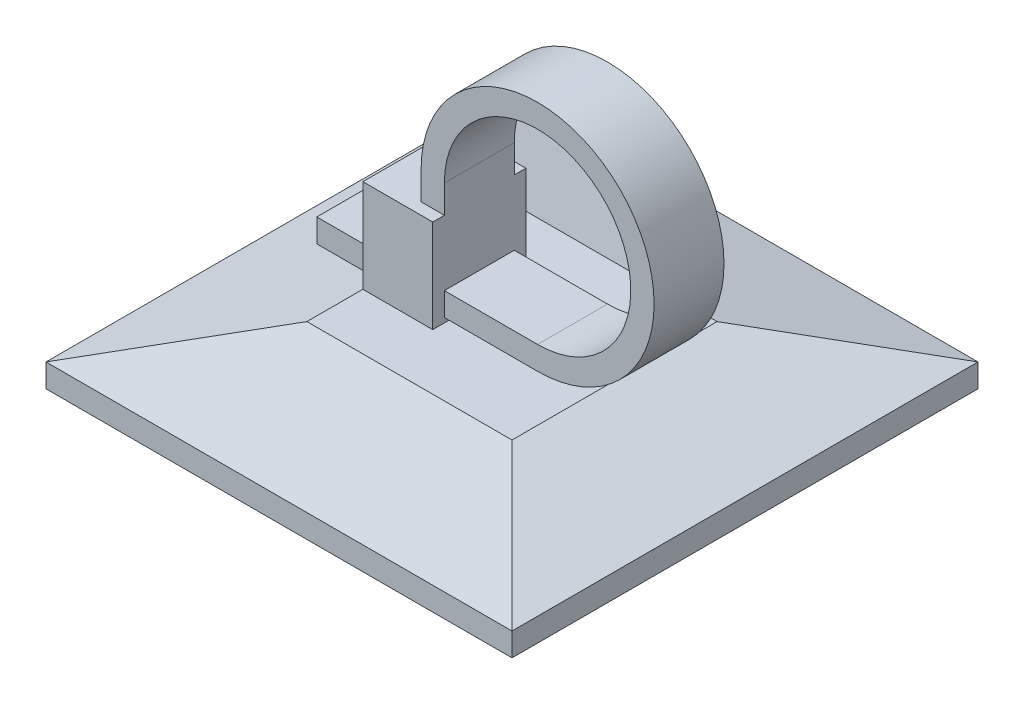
ISO-10303-21;
HEADER;
FILE_DESCRIPTION(('STEP AP214'),'2;1');
FILE_NAME('part.step','',(''),(''),'','','');
FILE_SCHEMA(('AUTOMOTIVE_DESIGN { 1 0 10303 214 1 1 1 1 }'));
ENDSEC;
DATA;
#1=APPLICATION_CONTEXT('core data for automotive mechanical design processes');
#2=APPLICATION_PROTOCOL_DEFINITION('international standard','automotive_design',2000,#1);
#3=PRODUCT_CONTEXT('',#1,'mechanical');
#4=PRODUCT('Part','Part','',(#3));
#5=PRODUCT_RELATED_PRODUCT_CATEGORY('part','',(#4));
#6=PRODUCT_DEFINITION_FORMATION('','',#4);
#7=PRODUCT_DEFINITION_CONTEXT('part definition',#1,'design');
#8=PRODUCT_DEFINITION('design','',#6,#7);
#9=PRODUCT_DEFINITION_SHAPE('','',#8);
#10=(LENGTH_UNIT() NAMED_UNIT(*) SI_UNIT(.MILLI.,.METRE.));
#11=(NAMED_UNIT(*) PLANE_ANGLE_UNIT() SI_UNIT($,.RADIAN.));
#12=(NAMED_UNIT(*) SI_UNIT($,.STERADIAN.) SOLID_ANGLE_UNIT());
#13=UNCERTAINTY_MEASURE_WITH_UNIT(LENGTH_MEASURE(1.E-05),#10,'distance_accuracy_value','');
#14=(GEOMETRIC_REPRESENTATION_CONTEXT(3) GLOBAL_UNCERTAINTY_ASSIGNED_CONTEXT((#13)) GLOBAL_UNIT_ASSIGNED_CONTEXT((#10,
#11,#12)) REPRESENTATION_CONTEXT('',''));
#15=CARTESIAN_POINT('',(0.,0.,0.));
#16=DIRECTION('',(0.,0.,1.));
#17=DIRECTION('',(1.,0.,0.));
#18=AXIS2_PLACEMENT_3D('',#15,#16,#17);
#19=CARTESIAN_POINT('',(-10.,2.5,-10.));
#20=DIRECTION('',(0.,1.,0.));
#21=DIRECTION('',(0.,0.,1.));
#22=AXIS2_PLACEMENT_3D('',#19,#20,#21);
#23=PLANE('',#22);
#24=DIRECTION('',(0.,0.,-1.));
#25=VECTOR('',#24,1.);
#26=CARTESIAN_POINT('',(-4.40192378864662,2.5,-10.));
#27=LINE('',#26,#25);
#28=CARTESIAN_POINT('',(-4.40192378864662,2.5,-4.40192378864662));
#29=VERTEX_POINT('',#28);
#30=CARTESIAN_POINT('',(-4.40192378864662,2.5,-2.));
#31=VERTEX_POINT('',#30);
#32=EDGE_CURVE('E300',#29,#31,#27,.F.);
#33=ORIENTED_EDGE('',*,*,#32,.T.);
#34=DIRECTION('',(1.,0.,0.));
#35=VECTOR('',#34,1.);
#36=CARTESIAN_POINT('',(-4.40192378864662,2.5,-2.));
#37=LINE('',#36,#35);
#38=CARTESIAN_POINT('',(-1.40192378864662,2.5,-2.));
#39=VERTEX_POINT('',#38);
#40=EDGE_CURVE('E277',#31,#39,#37,.T.);
#41=ORIENTED_EDGE('',*,*,#40,.T.);
#42=DIRECTION('',(0.,0.,-1.));
#43=VECTOR('',#42,1.);
#44=CARTESIAN_POINT('',(-1.40192378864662,2.5,2.));
#45=LINE('',#44,#43);
#46=CARTESIAN_POINT('',(-1.40192378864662,2.5,2.));
#47=VERTEX_POINT('',#46);
#48=EDGE_CURVE('E399',#47,#39,#45,.T.);
#49=ORIENTED_EDGE('',*,*,#48,.F.);
#50=DIRECTION('',(1.,0.,0.));
#51=VECTOR('',#50,1.);
#52=CARTESIAN_POINT('',(-4.40192378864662,2.5,2.));
#53=LINE('',#52,#51);
#54=CARTESIAN_POINT('',(-4.40192378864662,2.5,2.));
#55=VERTEX_POINT('',#54);
#56=EDGE_CURVE('E388',#55,#47,#53,.T.);
#57=ORIENTED_EDGE('',*,*,#56,.F.);
#58=CARTESIAN_POINT('',(-4.40192378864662,2.5,4.40192378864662));
#59=VERTEX_POINT('',#58);
#60=EDGE_CURVE('E305',#55,#59,#27,.F.);
#61=ORIENTED_EDGE('',*,*,#60,.T.);
#62=DIRECTION('',(-1.,0.,0.));
#63=VECTOR('',#62,1.);
#64=CARTESIAN_POINT('',(-10.,2.5,4.40192378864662));
#65=LINE('',#64,#63);
#66=CARTESIAN_POINT('',(4.40192378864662,2.5,4.40192378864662));
#67=VERTEX_POINT('',#66);
#68=EDGE_CURVE('E304',#59,#67,#65,.F.);
#69=ORIENTED_EDGE('',*,*,#68,.T.);
#70=DIRECTION('',(0.,0.,1.));
#71=VECTOR('',#70,1.);
#72=CARTESIAN_POINT('',(4.40192378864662,2.5,10.));
#73=LINE('',#72,#71);
#74=CARTESIAN_POINT('',(4.40192378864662,2.5,-4.40192378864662));
#75=VERTEX_POINT('',#74);
#76=EDGE_CURVE('E314',#67,#75,#73,.F.);
#77=ORIENTED_EDGE('',*,*,#76,.T.);
#78=DIRECTION('',(1.,0.,0.));
#79=VECTOR('',#78,1.);
#80=CARTESIAN_POINT('',(10.,2.5,-4.40192378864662));
#81=LINE('',#80,#79);
#82=EDGE_CURVE('E310',#75,#29,#81,.F.);
#83=ORIENTED_EDGE('',*,*,#82,.T.);
#84=EDGE_LOOP('',(#33,#41,#49,#57,#61,#69,#77,#83));
#85=FACE_BOUND('',#84,.T.);
#86=ADVANCED_FACE('F36',(#85),#23,.T.);
#87=CARTESIAN_POINT('',(-10.,1.,10.));
#88=DIRECTION('',(1.,0.,0.));
#89=DIRECTION('',(0.,0.,-1.));
#90=AXIS2_PLACEMENT_3D('',#87,#88,#89);
#91=PLANE('',#90);
#92=DIRECTION('',(0.,0.,1.));
#93=VECTOR('',#92,1.);
#94=CARTESIAN_POINT('',(-10.,0.,10.));
#95=LINE('',#94,#93);
#96=CARTESIAN_POINT('',(-10.,0.,-10.));
#97=VERTEX_POINT('',#96);
#98=CARTESIAN_POINT('',(-10.,0.,10.));
#99=VERTEX_POINT('',#98);
#100=EDGE_CURVE('E317',#97,#99,#95,.T.);
#101=ORIENTED_EDGE('',*,*,#100,.T.);
#102=DIRECTION('',(0.,-1.,0.));
#103=VECTOR('',#102,1.);
#104=CARTESIAN_POINT('',(-10.,1.,10.));
#105=LINE('',#104,#103);
#106=CARTESIAN_POINT('',(-10.,1.,10.));
#107=VERTEX_POINT('',#106);
#108=EDGE_CURVE('E285',#107,#99,#105,.T.);
#109=ORIENTED_EDGE('',*,*,#108,.F.);
#110=DIRECTION('',(0.,0.,1.));
#111=VECTOR('',#110,1.);
#112=CARTESIAN_POINT('',(-10.,1.,10.));
#113=LINE('',#112,#111);
#114=CARTESIAN_POINT('',(-10.,1.,-10.));
#115=VERTEX_POINT('',#114);
#116=EDGE_CURVE('E326',#115,#107,#113,.T.);
#117=ORIENTED_EDGE('',*,*,#116,.F.);
#118=DIRECTION('',(0.,-1.,0.));
#119=VECTOR('',#118,1.);
#120=CARTESIAN_POINT('',(-10.,1.,-10.));
#121=LINE('',#120,#119);
#122=EDGE_CURVE('E338',#115,#97,#121,.T.);
#123=ORIENTED_EDGE('',*,*,#122,.T.);
#124=EDGE_LOOP('',(#101,#109,#117,#123));
#125=FACE_BOUND('',#124,.T.);
#126=ADVANCED_FACE('F38',(#125),#91,.F.);
#127=CARTESIAN_POINT('',(-10.,1.,10.));
#128=DIRECTION('',(0.,0.,-1.));
#129=DIRECTION('',(-1.,0.,0.));
#130=AXIS2_PLACEMENT_3D('',#127,#128,#129);
#131=PLANE('',#130);
#132=DIRECTION('',(1.,0.,0.));
#133=VECTOR('',#132,1.);
#134=CARTESIAN_POINT('',(-10.,0.,10.));
#135=LINE('',#134,#133);
#136=CARTESIAN_POINT('',(10.,0.,10.));
#137=VERTEX_POINT('',#136);
#138=EDGE_CURVE('E319',#99,#137,#135,.T.);
#139=ORIENTED_EDGE('',*,*,#138,.T.);
#140=DIRECTION('',(0.,-1.,0.));
#141=VECTOR('',#140,1.);
#142=CARTESIAN_POINT('',(10.,1.,10.));
#143=LINE('',#142,#141);
#144=CARTESIAN_POINT('',(10.,1.,10.));
#145=VERTEX_POINT('',#144);
#146=EDGE_CURVE('E290',#145,#137,#143,.T.);
#147=ORIENTED_EDGE('',*,*,#146,.F.);
#148=DIRECTION('',(1.,0.,0.));
#149=VECTOR('',#148,1.);
#150=CARTESIAN_POINT('',(-10.,1.,10.));
#151=LINE('',#150,#149);
#152=EDGE_CURVE('E329',#107,#145,#151,.T.);
#153=ORIENTED_EDGE('',*,*,#152,.F.);
#154=ORIENTED_EDGE('',*,*,#108,.T.);
#155=EDGE_LOOP('',(#139,#147,#153,#154));
#156=FACE_BOUND('',#155,.T.);
#157=ADVANCED_FACE('F429',(#156),#131,.F.);
#158=CARTESIAN_POINT('',(10.,1.,10.));
#159=DIRECTION('',(-1.,0.,0.));
#160=DIRECTION('',(0.,0.,1.));
#161=AXIS2_PLACEMENT_3D('',#158,#159,#160);
#162=PLANE('',#161);
#163=DIRECTION('',(0.,0.,-1.));
#164=VECTOR('',#163,1.);
#165=CARTESIAN_POINT('',(10.,0.,10.));
#166=LINE('',#165,#164);
#167=CARTESIAN_POINT('',(10.,0.,-10.));
#168=VERTEX_POINT('',#167);
#169=EDGE_CURVE('E322',#137,#168,#166,.T.);
#170=ORIENTED_EDGE('',*,*,#169,.T.);
#171=DIRECTION('',(0.,-1.,0.));
#172=VECTOR('',#171,1.);
#173=CARTESIAN_POINT('',(10.,1.,-10.));
#174=LINE('',#173,#172);
#175=CARTESIAN_POINT('',(10.,1.,-10.));
#176=VERTEX_POINT('',#175);
#177=EDGE_CURVE('E296',#176,#168,#174,.T.);
#178=ORIENTED_EDGE('',*,*,#177,.F.);
#179=DIRECTION('',(0.,0.,-1.));
#180=VECTOR('',#179,1.);
#181=CARTESIAN_POINT('',(10.,1.,10.));
#182=LINE('',#181,#180);
#183=EDGE_CURVE('E332',#145,#176,#182,.T.);
#184=ORIENTED_EDGE('',*,*,#183,.F.);
#185=ORIENTED_EDGE('',*,*,#146,.T.);
#186=EDGE_LOOP('',(#170,#178,#184,#185));
#187=FACE_BOUND('',#186,.T.);
#188=ADVANCED_FACE('F428',(#187),#162,.F.);
#189=CARTESIAN_POINT('',(-10.,1.,-10.));
#190=DIRECTION('',(0.,0.,1.));
#191=DIRECTION('',(1.,0.,0.));
#192=AXIS2_PLACEMENT_3D('',#189,#190,#191);
#193=PLANE('',#192);
#194=DIRECTION('',(-1.,0.,0.));
#195=VECTOR('',#194,1.);
#196=CARTESIAN_POINT('',(-10.,0.,-10.));
#197=LINE('',#196,#195);
#198=EDGE_CURVE('E324',#168,#97,#197,.T.);
#199=ORIENTED_EDGE('',*,*,#198,.T.);
#200=ORIENTED_EDGE('',*,*,#122,.F.);
#201=DIRECTION('',(-1.,0.,0.));
#202=VECTOR('',#201,1.);
#203=CARTESIAN_POINT('',(-10.,1.,-10.));
#204=LINE('',#203,#202);
#205=EDGE_CURVE('E335',#176,#115,#204,.T.);
#206=ORIENTED_EDGE('',*,*,#205,.F.);
#207=ORIENTED_EDGE('',*,*,#177,.T.);
#208=EDGE_LOOP('',(#199,#200,#206,#207));
#209=FACE_BOUND('',#208,.T.);
#210=ADVANCED_FACE('F344',(#209),#193,.F.);
#211=CARTESIAN_POINT('',(-10.,0.,-10.));
#212=DIRECTION('',(0.,-1.,0.));
#213=DIRECTION('',(0.,0.,-1.));
#214=AXIS2_PLACEMENT_3D('',#211,#212,#213);
#215=PLANE('',#214);
#216=ORIENTED_EDGE('',*,*,#100,.F.);
#217=ORIENTED_EDGE('',*,*,#198,.F.);
#218=ORIENTED_EDGE('',*,*,#169,.F.);
#219=ORIENTED_EDGE('',*,*,#138,.F.);
#220=EDGE_LOOP('',(#216,#217,#218,#219));
#221=FACE_BOUND('',#220,.T.);
#222=ADVANCED_FACE('F351',(#221),#215,.T.);
#223=CARTESIAN_POINT('',(10.,1.,-10.));
#224=DIRECTION('',(0.,0.965925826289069,-0.258819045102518));
#225=DIRECTION('',(0.,0.258819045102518,0.965925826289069));
#226=AXIS2_PLACEMENT_3D('',#223,#224,#225);
#227=PLANE('',#226);
#228=ORIENTED_EDGE('',*,*,#205,.T.);
#229=DIRECTION('',(-0.694746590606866,-0.186156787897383,-0.694746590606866));
#230=VECTOR('',#229,1.);
#231=CARTESIAN_POINT('',(-10.,1.,-10.));
#232=LINE('',#231,#230);
#233=EDGE_CURVE('E320',#29,#115,#232,.T.);
#234=ORIENTED_EDGE('',*,*,#233,.F.);
#235=ORIENTED_EDGE('',*,*,#82,.F.);
#236=DIRECTION('',(0.694746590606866,-0.186156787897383,-0.694746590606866));
#237=VECTOR('',#236,1.);
#238=CARTESIAN_POINT('',(10.,1.,-10.));
#239=LINE('',#238,#237);
#240=EDGE_CURVE('E316',#75,#176,#239,.T.);
#241=ORIENTED_EDGE('',*,*,#240,.T.);
#242=EDGE_LOOP('',(#228,#234,#235,#241));
#243=FACE_BOUND('',#242,.T.);
#244=ADVANCED_FACE('F365',(#243),#227,.T.);
#245=CARTESIAN_POINT('',(-10.,1.,-10.));
#246=DIRECTION('',(-0.258819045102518,0.965925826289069,0.));
#247=DIRECTION('',(-0.965925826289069,-0.258819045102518,0.));
#248=AXIS2_PLACEMENT_3D('',#245,#246,#247);
#249=PLANE('',#248);
#250=ORIENTED_EDGE('',*,*,#116,.T.);
#251=DIRECTION('',(-0.694746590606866,-0.186156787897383,0.694746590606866));
#252=VECTOR('',#251,1.);
#253=CARTESIAN_POINT('',(-10.,1.,10.));
#254=LINE('',#253,#252);
#255=EDGE_CURVE('E362',#59,#107,#254,.T.);
#256=ORIENTED_EDGE('',*,*,#255,.F.);
#257=ORIENTED_EDGE('',*,*,#60,.F.);
#258=DIRECTION('',(0.,0.,-1.));
#259=VECTOR('',#258,1.);
#260=CARTESIAN_POINT('',(-4.40192378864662,2.5,2.));
#261=LINE('',#260,#259);
#262=EDGE_CURVE('E381',#55,#31,#261,.T.);
#263=ORIENTED_EDGE('',*,*,#262,.T.);
#264=ORIENTED_EDGE('',*,*,#32,.F.);
#265=ORIENTED_EDGE('',*,*,#233,.T.);
#266=EDGE_LOOP('',(#250,#256,#257,#263,#264,#265));
#267=FACE_BOUND('',#266,.T.);
#268=ADVANCED_FACE('F356',(#267),#249,.T.);
#269=CARTESIAN_POINT('',(-10.,1.,10.));
#270=DIRECTION('',(0.,0.965925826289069,0.258819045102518));
#271=DIRECTION('',(0.,-0.258819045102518,0.965925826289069));
#272=AXIS2_PLACEMENT_3D('',#269,#270,#271);
#273=PLANE('',#272);
#274=ORIENTED_EDGE('',*,*,#152,.T.);
#275=DIRECTION('',(0.694746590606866,-0.186156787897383,0.694746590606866));
#276=VECTOR('',#275,1.);
#277=CARTESIAN_POINT('',(10.,1.,10.));
#278=LINE('',#277,#276);
#279=EDGE_CURVE('E369',#67,#145,#278,.T.);
#280=ORIENTED_EDGE('',*,*,#279,.F.);
#281=ORIENTED_EDGE('',*,*,#68,.F.);
#282=ORIENTED_EDGE('',*,*,#255,.T.);
#283=EDGE_LOOP('',(#274,#280,#281,#282));
#284=FACE_BOUND('',#283,.T.);
#285=ADVANCED_FACE('F376',(#284),#273,.T.);
#286=CARTESIAN_POINT('',(10.,1.,10.));
#287=DIRECTION('',(0.258819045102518,0.965925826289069,0.));
#288=DIRECTION('',(-0.965925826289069,0.258819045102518,0.));
#289=AXIS2_PLACEMENT_3D('',#286,#287,#288);
#290=PLANE('',#289);
#291=ORIENTED_EDGE('',*,*,#183,.T.);
#292=ORIENTED_EDGE('',*,*,#240,.F.);
#293=ORIENTED_EDGE('',*,*,#76,.F.);
#294=ORIENTED_EDGE('',*,*,#279,.T.);
#295=EDGE_LOOP('',(#291,#292,#293,#294));
#296=FACE_BOUND('',#295,.T.);
#297=ADVANCED_FACE('F427',(#296),#290,.T.);
#298=CARTESIAN_POINT('',(-4.40192378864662,2.5,2.));
#299=DIRECTION('',(1.,0.,0.));
#300=DIRECTION('',(0.,1.,0.));
#301=AXIS2_PLACEMENT_3D('',#298,#299,#300);
#302=PLANE('',#301);
#303=DIRECTION('',(0.,0.,-1.));
#304=VECTOR('',#303,1.);
#305=CARTESIAN_POINT('',(-4.40192378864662,3.7,2.));
#306=LINE('',#305,#304);
#307=CARTESIAN_POINT('',(-4.40192378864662,3.7,1.5));
#308=VERTEX_POINT('',#307);
#309=CARTESIAN_POINT('',(-4.40192378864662,3.7,-1.5));
#310=VERTEX_POINT('',#309);
#311=EDGE_CURVE('E51',#308,#310,#306,.T.);
#312=ORIENTED_EDGE('',*,*,#311,.F.);
#313=DIRECTION('',(0.,-1.,0.));
#314=VECTOR('',#313,1.);
#315=CARTESIAN_POINT('',(-4.40192378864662,2.5,1.5));
#316=LINE('',#315,#314);
#317=CARTESIAN_POINT('',(-4.40192378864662,2.7,1.5));
#318=VERTEX_POINT('',#317);
#319=EDGE_CURVE('E55',#308,#318,#316,.T.);
#320=ORIENTED_EDGE('',*,*,#319,.T.);
#321=DIRECTION('',(0.,0.,-1.));
#322=VECTOR('',#321,1.);
#323=CARTESIAN_POINT('',(-4.40192378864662,2.7,2.));
#324=LINE('',#323,#322);
#325=CARTESIAN_POINT('',(-4.40192378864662,2.7,-1.5));
#326=VERTEX_POINT('',#325);
#327=EDGE_CURVE('E268',#318,#326,#324,.T.);
#328=ORIENTED_EDGE('',*,*,#327,.T.);
#329=DIRECTION('',(0.,-1.,0.));
#330=VECTOR('',#329,1.);
#331=CARTESIAN_POINT('',(-4.40192378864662,2.5,-1.5));
#332=LINE('',#331,#330);
#333=EDGE_CURVE('E263',#310,#326,#332,.T.);
#334=ORIENTED_EDGE('',*,*,#333,.F.);
#335=EDGE_LOOP('',(#312,#320,#328,#334));
#336=FACE_BOUND('',#335,.T.);
#337=DIRECTION('',(0.,-1.,0.));
#338=VECTOR('',#337,1.);
#339=CARTESIAN_POINT('',(-4.40192378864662,2.5,-2.));
#340=LINE('',#339,#338);
#341=CARTESIAN_POINT('',(-4.40192378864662,6.5,-2.));
#342=VERTEX_POINT('',#341);
#343=EDGE_CURVE('E271',#342,#31,#340,.T.);
#344=ORIENTED_EDGE('',*,*,#343,.T.);
#345=ORIENTED_EDGE('',*,*,#262,.F.);
#346=DIRECTION('',(0.,-1.,0.));
#347=VECTOR('',#346,1.);
#348=CARTESIAN_POINT('',(-4.40192378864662,2.5,2.));
#349=LINE('',#348,#347);
#350=CARTESIAN_POINT('',(-4.40192378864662,6.5,2.));
#351=VERTEX_POINT('',#350);
#352=EDGE_CURVE('E386',#351,#55,#349,.T.);
#353=ORIENTED_EDGE('',*,*,#352,.F.);
#354=DIRECTION('',(0.,0.,-1.));
#355=VECTOR('',#354,1.);
#356=CARTESIAN_POINT('',(-4.40192378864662,6.5,2.));
#357=LINE('',#356,#355);
#358=EDGE_CURVE('E409',#351,#342,#357,.T.);
#359=ORIENTED_EDGE('',*,*,#358,.T.);
#360=EDGE_LOOP('',(#344,#345,#353,#359));
#361=FACE_BOUND('',#360,.T.);
#362=ADVANCED_FACE('F397',(#336,#361),#302,.F.);
#363=CARTESIAN_POINT('',(-1.40192378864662,2.5,2.));
#364=DIRECTION('',(-1.,0.,0.));
#365=DIRECTION('',(0.,0.,1.));
#366=AXIS2_PLACEMENT_3D('',#363,#364,#365);
#367=PLANE('',#366);
#368=DIRECTION('',(0.,0.,1.));
#369=VECTOR('',#368,1.);
#370=CARTESIAN_POINT('',(-1.40192378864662,2.7,2.));
#371=LINE('',#370,#369);
#372=CARTESIAN_POINT('',(-1.40192378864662,2.7,-1.5));
#373=VERTEX_POINT('',#372);
#374=CARTESIAN_POINT('',(-1.40192378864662,2.7,1.5));
#375=VERTEX_POINT('',#374);
#376=EDGE_CURVE('E44',#373,#375,#371,.T.);
#377=ORIENTED_EDGE('',*,*,#376,.T.);
#378=DIRECTION('',(0.,1.,0.));
#379=VECTOR('',#378,1.);
#380=CARTESIAN_POINT('',(-1.40192378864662,2.5,1.5));
#381=LINE('',#380,#379);
#382=CARTESIAN_POINT('',(-1.40192378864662,3.7,1.5));
#383=VERTEX_POINT('',#382);
#384=EDGE_CURVE('E265',#375,#383,#381,.T.);
#385=ORIENTED_EDGE('',*,*,#384,.T.);
#386=DIRECTION('',(0.,0.,1.));
#387=VECTOR('',#386,1.);
#388=CARTESIAN_POINT('',(-1.40192378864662,3.7,2.));
#389=LINE('',#388,#387);
#390=CARTESIAN_POINT('',(-1.40192378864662,3.7,-1.5));
#391=VERTEX_POINT('',#390);
#392=EDGE_CURVE('E11',#391,#383,#389,.T.);
#393=ORIENTED_EDGE('',*,*,#392,.F.);
#394=DIRECTION('',(0.,1.,0.));
#395=VECTOR('',#394,1.);
#396=CARTESIAN_POINT('',(-1.40192378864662,2.5,-1.5));
#397=LINE('',#396,#395);
#398=EDGE_CURVE('E201',#373,#391,#397,.T.);
#399=ORIENTED_EDGE('',*,*,#398,.F.);
#400=EDGE_LOOP('',(#377,#385,#393,#399));
#401=FACE_BOUND('',#400,.T.);
#402=DIRECTION('',(0.,1.,0.));
#403=VECTOR('',#402,1.);
#404=CARTESIAN_POINT('',(-1.40192378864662,2.5,-2.));
#405=LINE('',#404,#403);
#406=CARTESIAN_POINT('',(-1.40192378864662,6.5,-2.));
#407=VERTEX_POINT('',#406);
#408=EDGE_CURVE('E274',#39,#407,#405,.T.);
#409=ORIENTED_EDGE('',*,*,#408,.T.);
#410=DIRECTION('',(0.,0.,-1.));
#411=VECTOR('',#410,1.);
#412=CARTESIAN_POINT('',(-1.40192378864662,6.5,2.));
#413=LINE('',#412,#411);
#414=CARTESIAN_POINT('',(-1.40192378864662,6.5,-1.5));
#415=VERTEX_POINT('',#414);
#416=EDGE_CURVE('E413',#415,#407,#413,.T.);
#417=ORIENTED_EDGE('',*,*,#416,.F.);
#418=DIRECTION('',(0.,1.,0.));
#419=VECTOR('',#418,1.);
#420=CARTESIAN_POINT('',(-1.40192378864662,6.5,-1.5));
#421=LINE('',#420,#419);
#422=CARTESIAN_POINT('',(-1.40192378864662,7.7,-1.5));
#423=VERTEX_POINT('',#422);
#424=EDGE_CURVE('E223',#415,#423,#421,.T.);
#425=ORIENTED_EDGE('',*,*,#424,.T.);
#426=DIRECTION('',(0.,0.,-1.));
#427=VECTOR('',#426,1.);
#428=CARTESIAN_POINT('',(-1.40192378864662,7.7,1.5));
#429=LINE('',#428,#427);
#430=CARTESIAN_POINT('',(-1.40192378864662,7.7,1.5));
#431=VERTEX_POINT('',#430);
#432=EDGE_CURVE('E251',#431,#423,#429,.T.);
#433=ORIENTED_EDGE('',*,*,#432,.F.);
#434=DIRECTION('',(0.,1.,0.));
#435=VECTOR('',#434,1.);
#436=CARTESIAN_POINT('',(-1.40192378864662,6.5,1.5));
#437=LINE('',#436,#435);
#438=CARTESIAN_POINT('',(-1.40192378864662,6.5,1.5));
#439=VERTEX_POINT('',#438);
#440=EDGE_CURVE('E244',#439,#431,#437,.T.);
#441=ORIENTED_EDGE('',*,*,#440,.F.);
#442=CARTESIAN_POINT('',(-1.40192378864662,6.5,2.));
#443=VERTEX_POINT('',#442);
#444=EDGE_CURVE('E401',#443,#439,#413,.T.);
#445=ORIENTED_EDGE('',*,*,#444,.F.);
#446=DIRECTION('',(0.,1.,0.));
#447=VECTOR('',#446,1.);
#448=CARTESIAN_POINT('',(-1.40192378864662,2.5,2.));
#449=LINE('',#448,#447);
#450=EDGE_CURVE('E406',#47,#443,#449,.T.);
#451=ORIENTED_EDGE('',*,*,#450,.F.);
#452=ORIENTED_EDGE('',*,*,#48,.T.);
#453=EDGE_LOOP('',(#409,#417,#425,#433,#441,#445,#451,#452));
#454=FACE_BOUND('',#453,.T.);
#455=ADVANCED_FACE('F423',(#401,#454),#367,.F.);
#456=CARTESIAN_POINT('',(-4.40192378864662,6.5,2.));
#457=DIRECTION('',(0.,-1.,0.));
#458=DIRECTION('',(1.,0.,0.));
#459=AXIS2_PLACEMENT_3D('',#456,#457,#458);
#460=PLANE('',#459);
#461=ORIENTED_EDGE('',*,*,#444,.T.);
#462=DIRECTION('',(-1.,0.,0.));
#463=VECTOR('',#462,1.);
#464=CARTESIAN_POINT('',(-1.40192378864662,6.5,1.5));
#465=LINE('',#464,#463);
#466=CARTESIAN_POINT('',(-2.40192378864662,6.5,1.5));
#467=VERTEX_POINT('',#466);
#468=EDGE_CURVE('E242',#439,#467,#465,.T.);
#469=ORIENTED_EDGE('',*,*,#468,.T.);
#470=DIRECTION('',(0.,0.,-1.));
#471=VECTOR('',#470,1.);
#472=CARTESIAN_POINT('',(-2.40192378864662,6.5,1.5));
#473=LINE('',#472,#471);
#474=CARTESIAN_POINT('',(-2.40192378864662,6.5,-1.5));
#475=VERTEX_POINT('',#474);
#476=EDGE_CURVE('E254',#467,#475,#473,.T.);
#477=ORIENTED_EDGE('',*,*,#476,.T.);
#478=DIRECTION('',(-1.,0.,0.));
#479=VECTOR('',#478,1.);
#480=CARTESIAN_POINT('',(-1.40192378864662,6.5,-1.5));
#481=LINE('',#480,#479);
#482=EDGE_CURVE('E220',#415,#475,#481,.T.);
#483=ORIENTED_EDGE('',*,*,#482,.F.);
#484=ORIENTED_EDGE('',*,*,#416,.T.);
#485=DIRECTION('',(-1.,0.,0.));
#486=VECTOR('',#485,1.);
#487=CARTESIAN_POINT('',(-4.40192378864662,6.5,-2.));
#488=LINE('',#487,#486);
#489=EDGE_CURVE('E395',#407,#342,#488,.T.);
#490=ORIENTED_EDGE('',*,*,#489,.T.);
#491=ORIENTED_EDGE('',*,*,#358,.F.);
#492=DIRECTION('',(-1.,0.,0.));
#493=VECTOR('',#492,1.);
#494=CARTESIAN_POINT('',(-4.40192378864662,6.5,2.));
#495=LINE('',#494,#493);
#496=EDGE_CURVE('E391',#443,#351,#495,.T.);
#497=ORIENTED_EDGE('',*,*,#496,.F.);
#498=EDGE_LOOP('',(#461,#469,#477,#483,#484,#490,#491,#497));
#499=FACE_BOUND('',#498,.T.);
#500=ADVANCED_FACE('F418',(#499),#460,.F.);
#501=CARTESIAN_POINT('',(-4.40192378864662,2.5,2.));
#502=DIRECTION('',(0.,0.,-1.));
#503=DIRECTION('',(-1.,0.,0.));
#504=AXIS2_PLACEMENT_3D('',#501,#502,#503);
#505=PLANE('',#504);
#506=ORIENTED_EDGE('',*,*,#352,.T.);
#507=ORIENTED_EDGE('',*,*,#56,.T.);
#508=ORIENTED_EDGE('',*,*,#450,.T.);
#509=ORIENTED_EDGE('',*,*,#496,.T.);
#510=EDGE_LOOP('',(#506,#507,#508,#509));
#511=FACE_BOUND('',#510,.T.);
#512=ADVANCED_FACE('F387',(#511),#505,.F.);
#513=CARTESIAN_POINT('',(-4.40192378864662,2.5,-2.));
#514=DIRECTION('',(0.,0.,-1.));
#515=DIRECTION('',(-1.,0.,0.));
#516=AXIS2_PLACEMENT_3D('',#513,#514,#515);
#517=PLANE('',#516);
#518=ORIENTED_EDGE('',*,*,#343,.F.);
#519=ORIENTED_EDGE('',*,*,#489,.F.);
#520=ORIENTED_EDGE('',*,*,#408,.F.);
#521=ORIENTED_EDGE('',*,*,#40,.F.);
#522=EDGE_LOOP('',(#518,#519,#520,#521));
#523=FACE_BOUND('',#522,.T.);
#524=ADVANCED_FACE('F426',(#523),#517,.T.);
#525=CARTESIAN_POINT('',(2.59807621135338,7.7,1.5));
#526=DIRECTION('',(0.,0.,-1.));
#527=DIRECTION('',(-1.,0.,0.));
#528=AXIS2_PLACEMENT_3D('',#525,#526,#527);
#529=CYLINDRICAL_SURFACE('',#528,5.);
#530=CARTESIAN_POINT('',(2.59807621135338,7.7,-1.5));
#531=DIRECTION('',(0.,0.,1.));
#532=DIRECTION('',(1.,0.,0.));
#533=AXIS2_PLACEMENT_3D('',#530,#531,#532);
#534=CIRCLE('',#533,5.);
#535=CARTESIAN_POINT('',(-2.40192378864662,7.7,-1.5));
#536=VERTEX_POINT('',#535);
#537=CARTESIAN_POINT('',(2.59807621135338,2.7,-1.5));
#538=VERTEX_POINT('',#537);
#539=EDGE_CURVE('E214',#536,#538,#534,.F.);
#540=ORIENTED_EDGE('',*,*,#539,.F.);
#541=DIRECTION('',(0.,0.,-1.));
#542=VECTOR('',#541,1.);
#543=CARTESIAN_POINT('',(-2.40192378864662,7.7,1.5));
#544=LINE('',#543,#542);
#545=CARTESIAN_POINT('',(-2.40192378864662,7.7,1.5));
#546=VERTEX_POINT('',#545);
#547=EDGE_CURVE('E256',#546,#536,#544,.T.);
#548=ORIENTED_EDGE('',*,*,#547,.F.);
#549=CARTESIAN_POINT('',(2.59807621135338,7.7,1.5));
#550=DIRECTION('',(0.,0.,1.));
#551=DIRECTION('',(1.,0.,0.));
#552=AXIS2_PLACEMENT_3D('',#549,#550,#551);
#553=CIRCLE('',#552,5.);
#554=CARTESIAN_POINT('',(2.59807621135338,2.7,1.5));
#555=VERTEX_POINT('',#554);
#556=EDGE_CURVE('E236',#546,#555,#553,.F.);
#557=ORIENTED_EDGE('',*,*,#556,.T.);
#558=DIRECTION('',(0.,0.,-1.));
#559=VECTOR('',#558,1.);
#560=CARTESIAN_POINT('',(2.59807621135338,2.7,1.5));
#561=LINE('',#560,#559);
#562=EDGE_CURVE('E258',#555,#538,#561,.T.);
#563=ORIENTED_EDGE('',*,*,#562,.T.);
#564=EDGE_LOOP('',(#540,#548,#557,#563));
#565=FACE_BOUND('',#564,.T.);
#566=ADVANCED_FACE('F508',(#565),#529,.T.);
#567=CARTESIAN_POINT('',(2.59807621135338,7.7,1.5));
#568=DIRECTION('',(0.,0.,-1.));
#569=DIRECTION('',(-1.,0.,0.));
#570=AXIS2_PLACEMENT_3D('',#567,#568,#569);
#571=CYLINDRICAL_SURFACE('',#570,4.);
#572=CARTESIAN_POINT('',(2.59807621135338,7.7,-1.5));
#573=DIRECTION('',(0.,0.,-1.));
#574=DIRECTION('',(-1.,0.,0.));
#575=AXIS2_PLACEMENT_3D('',#572,#573,#574);
#576=CIRCLE('',#575,4.);
#577=CARTESIAN_POINT('',(2.59807621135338,3.7,-1.5));
#578=VERTEX_POINT('',#577);
#579=EDGE_CURVE('E225',#423,#578,#576,.T.);
#580=ORIENTED_EDGE('',*,*,#579,.T.);
#581=DIRECTION('',(0.,0.,-1.));
#582=VECTOR('',#581,1.);
#583=CARTESIAN_POINT('',(2.59807621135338,3.7,1.5));
#584=LINE('',#583,#582);
#585=CARTESIAN_POINT('',(2.59807621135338,3.7,1.5));
#586=VERTEX_POINT('',#585);
#587=EDGE_CURVE('E248',#586,#578,#584,.T.);
#588=ORIENTED_EDGE('',*,*,#587,.F.);
#589=CARTESIAN_POINT('',(2.59807621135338,7.7,1.5));
#590=DIRECTION('',(0.,0.,-1.));
#591=DIRECTION('',(-1.,0.,0.));
#592=AXIS2_PLACEMENT_3D('',#589,#590,#591);
#593=CIRCLE('',#592,4.);
#594=EDGE_CURVE('E246',#431,#586,#593,.T.);
#595=ORIENTED_EDGE('',*,*,#594,.F.);
#596=ORIENTED_EDGE('',*,*,#432,.T.);
#597=EDGE_LOOP('',(#580,#588,#595,#596));
#598=FACE_BOUND('',#597,.T.);
#599=ADVANCED_FACE('F514',(#598),#571,.F.);
#600=CARTESIAN_POINT('',(2.59807621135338,7.7,1.5));
#601=DIRECTION('',(0.,0.,1.));
#602=DIRECTION('',(1.,0.,0.));
#603=AXIS2_PLACEMENT_3D('',#600,#601,#602);
#604=PLANE('',#603);
#605=ORIENTED_EDGE('',*,*,#384,.F.);
#606=DIRECTION('',(-1.,0.,0.));
#607=VECTOR('',#606,1.);
#608=CARTESIAN_POINT('',(2.59807621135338,2.7,1.5));
#609=LINE('',#608,#607);
#610=EDGE_CURVE('E233',#555,#375,#609,.T.);
#611=ORIENTED_EDGE('',*,*,#610,.F.);
#612=ORIENTED_EDGE('',*,*,#556,.F.);
#613=DIRECTION('',(0.,1.,0.));
#614=VECTOR('',#613,1.);
#615=CARTESIAN_POINT('',(-2.40192378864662,6.5,1.5));
#616=LINE('',#615,#614);
#617=EDGE_CURVE('E239',#467,#546,#616,.T.);
#618=ORIENTED_EDGE('',*,*,#617,.F.);
#619=ORIENTED_EDGE('',*,*,#468,.F.);
#620=ORIENTED_EDGE('',*,*,#440,.T.);
#621=ORIENTED_EDGE('',*,*,#594,.T.);
#622=DIRECTION('',(-1.,0.,0.));
#623=VECTOR('',#622,1.);
#624=CARTESIAN_POINT('',(2.59807621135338,3.7,1.5));
#625=LINE('',#624,#623);
#626=EDGE_CURVE('E228',#586,#383,#625,.T.);
#627=ORIENTED_EDGE('',*,*,#626,.T.);
#628=EDGE_LOOP('',(#605,#611,#612,#618,#619,#620,#621,#627));
#629=FACE_BOUND('',#628,.T.);
#630=ADVANCED_FACE('F522',(#629),#604,.T.);
#631=CARTESIAN_POINT('',(2.59807621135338,7.7,-1.5));
#632=DIRECTION('',(0.,0.,1.));
#633=DIRECTION('',(1.,0.,0.));
#634=AXIS2_PLACEMENT_3D('',#631,#632,#633);
#635=PLANE('',#634);
#636=DIRECTION('',(-1.,0.,0.));
#637=VECTOR('',#636,1.);
#638=CARTESIAN_POINT('',(2.59807621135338,2.7,-1.5));
#639=LINE('',#638,#637);
#640=EDGE_CURVE('E209',#538,#373,#639,.T.);
#641=ORIENTED_EDGE('',*,*,#640,.T.);
#642=ORIENTED_EDGE('',*,*,#398,.T.);
#643=DIRECTION('',(-1.,0.,0.));
#644=VECTOR('',#643,1.);
#645=CARTESIAN_POINT('',(2.59807621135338,3.7,-1.5));
#646=LINE('',#645,#644);
#647=EDGE_CURVE('E192',#578,#391,#646,.T.);
#648=ORIENTED_EDGE('',*,*,#647,.F.);
#649=ORIENTED_EDGE('',*,*,#579,.F.);
#650=ORIENTED_EDGE('',*,*,#424,.F.);
#651=ORIENTED_EDGE('',*,*,#482,.T.);
#652=DIRECTION('',(0.,1.,0.));
#653=VECTOR('',#652,1.);
#654=CARTESIAN_POINT('',(-2.40192378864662,6.5,-1.5));
#655=LINE('',#654,#653);
#656=EDGE_CURVE('E217',#475,#536,#655,.T.);
#657=ORIENTED_EDGE('',*,*,#656,.T.);
#658=ORIENTED_EDGE('',*,*,#539,.T.);
#659=EDGE_LOOP('',(#641,#642,#648,#649,#650,#651,#657,#658));
#660=FACE_BOUND('',#659,.T.);
#661=ADVANCED_FACE('F530',(#660),#635,.F.);
#662=CARTESIAN_POINT('',(-2.40192378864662,6.5,1.5));
#663=DIRECTION('',(-1.,0.,0.));
#664=DIRECTION('',(0.,0.,1.));
#665=AXIS2_PLACEMENT_3D('',#662,#663,#664);
#666=PLANE('',#665);
#667=ORIENTED_EDGE('',*,*,#656,.F.);
#668=ORIENTED_EDGE('',*,*,#476,.F.);
#669=ORIENTED_EDGE('',*,*,#617,.T.);
#670=ORIENTED_EDGE('',*,*,#547,.T.);
#671=EDGE_LOOP('',(#667,#668,#669,#670));
#672=FACE_BOUND('',#671,.T.);
#673=ADVANCED_FACE('F539',(#672),#666,.T.);
#674=CARTESIAN_POINT('',(2.59807621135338,2.7,1.5));
#675=DIRECTION('',(0.,-1.,0.));
#676=DIRECTION('',(1.,0.,0.));
#677=AXIS2_PLACEMENT_3D('',#674,#675,#676);
#678=PLANE('',#677);
#679=ORIENTED_EDGE('',*,*,#376,.F.);
#680=ORIENTED_EDGE('',*,*,#640,.F.);
#681=ORIENTED_EDGE('',*,*,#562,.F.);
#682=ORIENTED_EDGE('',*,*,#610,.T.);
#683=EDGE_LOOP('',(#679,#680,#681,#682));
#684=FACE_BOUND('',#683,.T.);
#685=ADVANCED_FACE('F547',(#684),#678,.T.);
#686=CARTESIAN_POINT('',(2.59807621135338,3.7,1.5));
#687=DIRECTION('',(0.,-1.,0.));
#688=DIRECTION('',(1.,0.,0.));
#689=AXIS2_PLACEMENT_3D('',#686,#687,#688);
#690=PLANE('',#689);
#691=ORIENTED_EDGE('',*,*,#647,.T.);
#692=ORIENTED_EDGE('',*,*,#392,.T.);
#693=ORIENTED_EDGE('',*,*,#626,.F.);
#694=ORIENTED_EDGE('',*,*,#587,.T.);
#695=EDGE_LOOP('',(#691,#692,#693,#694));
#696=FACE_BOUND('',#695,.T.);
#697=ADVANCED_FACE('F555',(#696),#690,.F.);
#698=CARTESIAN_POINT('',(-6.87859684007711,3.7,1.5));
#699=VERTEX_POINT('',#698);
#700=EDGE_CURVE('E227',#308,#699,#625,.T.);
#701=ORIENTED_EDGE('',*,*,#700,.F.);
#702=ORIENTED_EDGE('',*,*,#311,.T.);
#703=CARTESIAN_POINT('',(-6.87859684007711,3.7,-1.5));
#704=VERTEX_POINT('',#703);
#705=EDGE_CURVE('E183',#310,#704,#646,.T.);
#706=ORIENTED_EDGE('',*,*,#705,.T.);
#707=DIRECTION('',(0.,0.,-1.));
#708=VECTOR('',#707,1.);
#709=CARTESIAN_POINT('',(-6.87859684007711,3.7,1.5));
#710=LINE('',#709,#708);
#711=EDGE_CURVE('E187',#699,#704,#710,.T.);
#712=ORIENTED_EDGE('',*,*,#711,.F.);
#713=EDGE_LOOP('',(#701,#702,#706,#712));
#714=FACE_BOUND('',#713,.T.);
#715=ADVANCED_FACE('F186',(#714),#690,.F.);
#716=ORIENTED_EDGE('',*,*,#327,.F.);
#717=CARTESIAN_POINT('',(-6.87859684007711,2.7,1.5));
#718=VERTEX_POINT('',#717);
#719=EDGE_CURVE('E232',#318,#718,#609,.T.);
#720=ORIENTED_EDGE('',*,*,#719,.T.);
#721=DIRECTION('',(0.,0.,-1.));
#722=VECTOR('',#721,1.);
#723=CARTESIAN_POINT('',(-6.87859684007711,2.7,1.5));
#724=LINE('',#723,#722);
#725=CARTESIAN_POINT('',(-6.87859684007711,2.7,-1.5));
#726=VERTEX_POINT('',#725);
#727=EDGE_CURVE('E202',#718,#726,#724,.T.);
#728=ORIENTED_EDGE('',*,*,#727,.T.);
#729=EDGE_CURVE('E206',#326,#726,#639,.T.);
#730=ORIENTED_EDGE('',*,*,#729,.F.);
#731=EDGE_LOOP('',(#716,#720,#728,#730));
#732=FACE_BOUND('',#731,.T.);
#733=ADVANCED_FACE('F558',(#732),#678,.T.);
#734=ORIENTED_EDGE('',*,*,#319,.F.);
#735=ORIENTED_EDGE('',*,*,#700,.T.);
#736=DIRECTION('',(0.,1.,0.));
#737=VECTOR('',#736,1.);
#738=CARTESIAN_POINT('',(-6.87859684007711,2.7,1.5));
#739=LINE('',#738,#737);
#740=EDGE_CURVE('E200',#718,#699,#739,.T.);
#741=ORIENTED_EDGE('',*,*,#740,.F.);
#742=ORIENTED_EDGE('',*,*,#719,.F.);
#743=EDGE_LOOP('',(#734,#735,#741,#742));
#744=FACE_BOUND('',#743,.T.);
#745=ADVANCED_FACE('F533',(#744),#604,.T.);
#746=ORIENTED_EDGE('',*,*,#705,.F.);
#747=ORIENTED_EDGE('',*,*,#333,.T.);
#748=ORIENTED_EDGE('',*,*,#729,.T.);
#749=DIRECTION('',(0.,1.,0.));
#750=VECTOR('',#749,1.);
#751=CARTESIAN_POINT('',(-6.87859684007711,2.7,-1.5));
#752=LINE('',#751,#750);
#753=EDGE_CURVE('E198',#726,#704,#752,.T.);
#754=ORIENTED_EDGE('',*,*,#753,.T.);
#755=EDGE_LOOP('',(#746,#747,#748,#754));
#756=FACE_BOUND('',#755,.T.);
#757=ADVANCED_FACE('F204',(#756),#635,.F.);
#758=CARTESIAN_POINT('',(-6.87859684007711,2.7,1.5));
#759=DIRECTION('',(-1.,0.,0.));
#760=DIRECTION('',(0.,0.,1.));
#761=AXIS2_PLACEMENT_3D('',#758,#759,#760);
#762=PLANE('',#761);
#763=ORIENTED_EDGE('',*,*,#753,.F.);
#764=ORIENTED_EDGE('',*,*,#727,.F.);
#765=ORIENTED_EDGE('',*,*,#740,.T.);
#766=ORIENTED_EDGE('',*,*,#711,.T.);
#767=EDGE_LOOP('',(#763,#764,#765,#766));
#768=FACE_BOUND('',#767,.T.);
#769=ADVANCED_FACE('F196',(#768),#762,.T.);
#770=CLOSED_SHELL('',(#86,#126,#157,#188,#210,#222,#244,#268,#285,#297,#362,#455,#500,#512,#524,
#566,#599,#630,#661,#673,#685,#697,#715,#733,#745,#757,#769));
#771=MANIFOLD_SOLID_BREP('B2',#770);
#772=ADVANCED_BREP_SHAPE_REPRESENTATION('',(#18,#771),#14);
#773=SHAPE_DEFINITION_REPRESENTATION(#9,#772);
ENDSEC;
END-ISO-10303-21;
